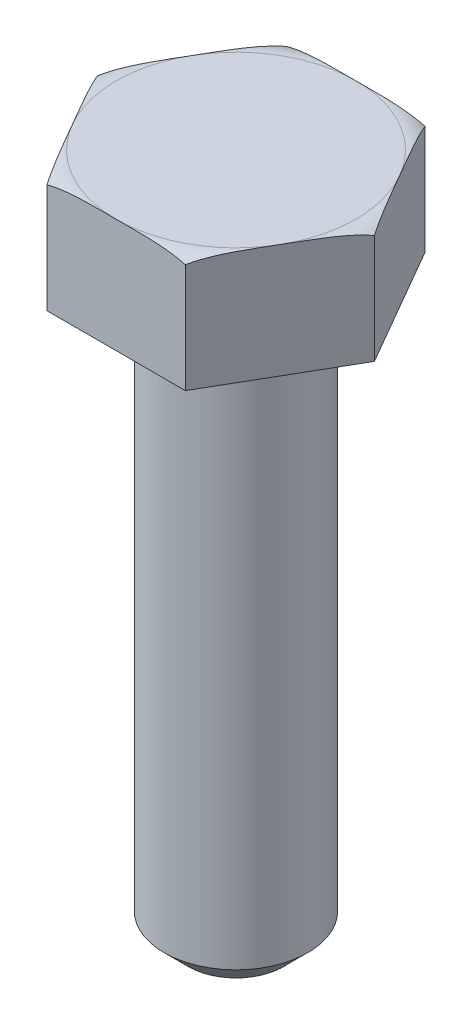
from build123d import *

# Parameters (mm, degrees)
EXTRUSION1_DEPTH = 3.8


with BuildPart() as part:
    # Esquisse4 → Extrusion1 (new body)
    with BuildSketch(Plane(origin=(0, 0, 0), x_dir=(1, 0, 0), z_dir=(0, 1, 0))):
        Polygon((4.618802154, 0), (2.309401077, 4), (-2.309401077, 4), (-4.618802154, 0), (-2.309401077, -4), (2.309401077, -4), align=None)
    extrude(amount=EXTRUSION1_DEPTH)

    # Esquisse2 → Enl_vement de mati_re-R_volution1 (revolve, cut)
    with BuildSketch(Plane(origin=(0, 6, 0), x_dir=(1, 0, 0), z_dir=(0, 0, -1))):
        with BuildLine():
            Line((4, 2.2), (4.618802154, 2.2))
            Line((4.618802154, 2.2), (4.618802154, 2.361438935))
            ThreePointArc((4.618802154, 2.361438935), (4.319757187, 2.241024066), (4, 2.2))
        make_face()
    revolve(axis=Axis((0, 0, 0), (0, 1, 0)), mode=Mode.SUBTRACT)


with BuildPart() as body_2:
    # Esquisse1 → R_volution1 (revolve)
    with BuildSketch(Plane.XY, mode=Mode.PRIVATE) as r_volution1_sk:
        with BuildLine():
            Line((0, 0), (2.64, 0))
            ThreePointArc((2.64, 0), (2.470294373, -0.070294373), (2.4, -0.24))
            Line((2.4, -0.24), (2.4, -18.2))
            Line((2.4, -18.2), (1.6, -19))
            Line((1.6, -19), (0, -19))
            Line((0, -19), (0, 0))
        make_face()
    revolve(r_volution1_sk.sketch.rotate(Axis((0, 0, 0), (0, -1, 0)), 180), axis=Axis((0, 0, 0), (0, -1, 0)))


solid = Compound([part.part, body_2.part])
